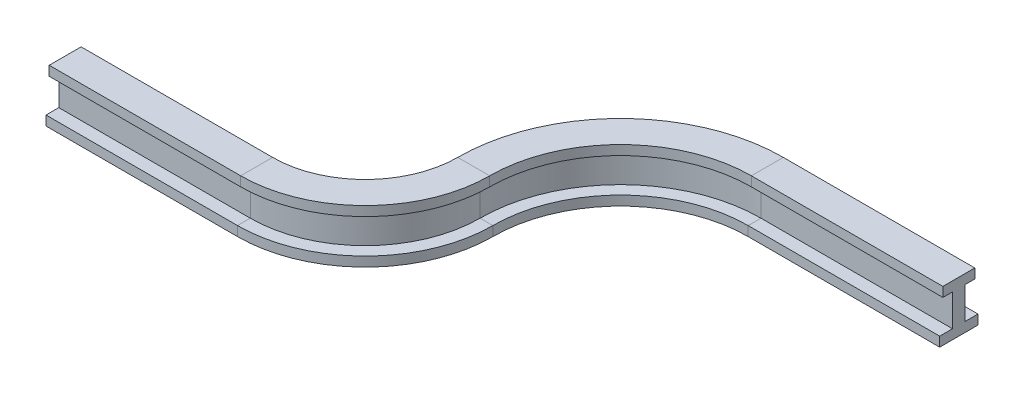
from build123d import *


with BuildPart() as part:
    # Sweep1: sweep along a path in Sketch1
    with BuildLine(Plane(origin=(0, 0, 0), x_dir=(1, 0, 0), z_dir=(0, 1, 0))) as sweep1_path:
        Line((0, 0), (-30, 0))
        ThreePointArc((-30, 0), (-44.142135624, -5.857864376), (-50, -20))
        ThreePointArc((-50, -20), (-55.857864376, -34.142135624), (-70, -40))
        Line((-70, -40), (-100, -40))
    # Sketch2 → Sweep1 (sweep)
    with BuildSketch(Plane(origin=(0, 0, 0), x_dir=(0, 0, -1), z_dir=(1, 0, 0))):
        Polygon((2, 1.5), (2, 6.5), (0.5, 6.5), (0.5, 8), (5.5, 8), (5.5, 6.5), (4, 6.5), (4, 1.5), (6, 1.5), (6, 0), (0, 0), (0, 1.5), align=None)
    sweep(path=sweep1_path.line)


solid = part.part
